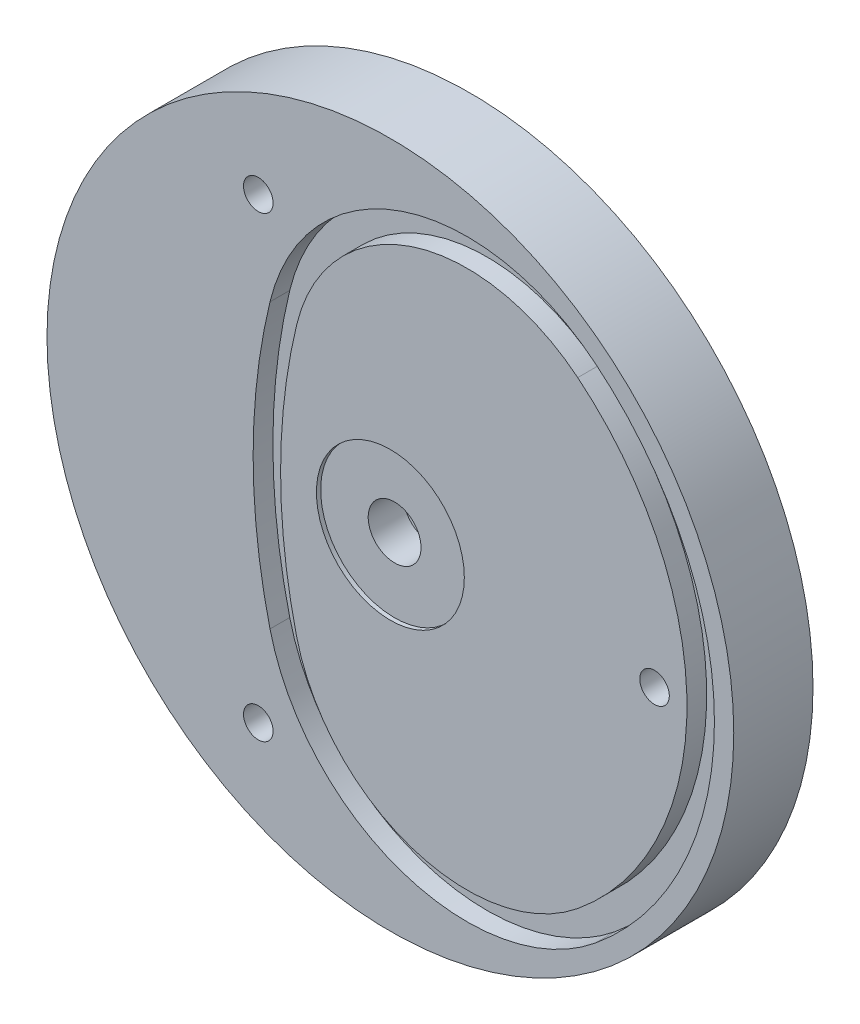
ISO-10303-21;
HEADER;
FILE_DESCRIPTION(('STEP AP214'),'2;1');
FILE_NAME('part.step','',(''),(''),'','','');
FILE_SCHEMA(('AUTOMOTIVE_DESIGN { 1 0 10303 214 1 1 1 1 }'));
ENDSEC;
DATA;
#1=APPLICATION_CONTEXT('core data for automotive mechanical design processes');
#2=APPLICATION_PROTOCOL_DEFINITION('international standard','automotive_design',2000,#1);
#3=PRODUCT_CONTEXT('',#1,'mechanical');
#4=PRODUCT('Part','Part','',(#3));
#5=PRODUCT_RELATED_PRODUCT_CATEGORY('part','',(#4));
#6=PRODUCT_DEFINITION_FORMATION('','',#4);
#7=PRODUCT_DEFINITION_CONTEXT('part definition',#1,'design');
#8=PRODUCT_DEFINITION('design','',#6,#7);
#9=PRODUCT_DEFINITION_SHAPE('','',#8);
#10=(LENGTH_UNIT() NAMED_UNIT(*) SI_UNIT(.MILLI.,.METRE.));
#11=(NAMED_UNIT(*) PLANE_ANGLE_UNIT() SI_UNIT($,.RADIAN.));
#12=(NAMED_UNIT(*) SI_UNIT($,.STERADIAN.) SOLID_ANGLE_UNIT());
#13=UNCERTAINTY_MEASURE_WITH_UNIT(LENGTH_MEASURE(1.E-05),#10,'distance_accuracy_value','');
#14=(GEOMETRIC_REPRESENTATION_CONTEXT(3) GLOBAL_UNCERTAINTY_ASSIGNED_CONTEXT((#13)) GLOBAL_UNIT_ASSIGNED_CONTEXT((#10,
#11,#12)) REPRESENTATION_CONTEXT('',''));
#15=CARTESIAN_POINT('',(0.,0.,0.));
#16=DIRECTION('',(0.,0.,1.));
#17=DIRECTION('',(1.,0.,0.));
#18=AXIS2_PLACEMENT_3D('',#15,#16,#17);
#19=CARTESIAN_POINT('',(0.,0.,19.05));
#20=DIRECTION('',(0.,0.,1.));
#21=DIRECTION('',(1.,0.,0.));
#22=AXIS2_PLACEMENT_3D('',#19,#20,#21);
#23=PLANE('',#22);
#24=CARTESIAN_POINT('',(-31.7499999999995,54.9926131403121,19.05));
#25=DIRECTION('',(0.,0.,1.));
#26=DIRECTION('',(-0.499999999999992,0.866025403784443,0.));
#27=AXIS2_PLACEMENT_3D('',#24,#25,#26);
#28=CIRCLE('',#27,3.556);
#29=CARTESIAN_POINT('',(-33.5279999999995,58.0721994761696,19.05));
#30=VERTEX_POINT('',#29);
#31=EDGE_CURVE('E174',#30,#30,#28,.T.);
#32=ORIENTED_EDGE('',*,*,#31,.F.);
#33=EDGE_LOOP('',(#32));
#34=FACE_BOUND('',#33,.T.);
#35=CARTESIAN_POINT('',(-31.7500000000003,-54.9926131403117,19.05));
#36=DIRECTION('',(0.,0.,1.));
#37=DIRECTION('',(-0.500000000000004,-0.866025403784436,0.));
#38=AXIS2_PLACEMENT_3D('',#35,#36,#37);
#39=CIRCLE('',#38,3.556);
#40=CARTESIAN_POINT('',(-33.5280000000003,-58.0721994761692,19.05));
#41=VERTEX_POINT('',#40);
#42=EDGE_CURVE('E180',#41,#41,#39,.T.);
#43=ORIENTED_EDGE('',*,*,#42,.F.);
#44=EDGE_LOOP('',(#43));
#45=FACE_BOUND('',#44,.T.);
#46=CARTESIAN_POINT('',(0.,0.,19.05));
#47=DIRECTION('',(0.,0.,1.));
#48=DIRECTION('',(1.,0.,0.));
#49=AXIS2_PLACEMENT_3D('',#46,#47,#48);
#50=CIRCLE('',#49,82.55);
#51=CARTESIAN_POINT('',(-82.55,0.,19.05));
#52=VERTEX_POINT('',#51);
#53=EDGE_CURVE('E11',#52,#52,#50,.T.);
#54=ORIENTED_EDGE('',*,*,#53,.T.);
#55=EDGE_LOOP('',(#54));
#56=FACE_BOUND('',#55,.T.);
#57=CARTESIAN_POINT('',(0.,0.,19.05));
#58=DIRECTION('',(0.,0.,-1.));
#59=DIRECTION('',(-1.,0.,0.));
#60=AXIS2_PLACEMENT_3D('',#57,#58,#59);
#61=CIRCLE('',#60,77.9018);
#62=CARTESIAN_POINT('',(49.2169599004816,60.3852738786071,19.05));
#63=VERTEX_POINT('',#62);
#64=CARTESIAN_POINT('',(49.2169599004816,-60.3852738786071,19.05));
#65=VERTEX_POINT('',#64);
#66=EDGE_CURVE('E146',#63,#65,#61,.T.);
#67=ORIENTED_EDGE('',*,*,#66,.T.);
#68=CARTESIAN_POINT('',(18.4291778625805,-22.611127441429,19.05));
#69=DIRECTION('',(0.,0.,-1.));
#70=DIRECTION('',(1.,0.,0.));
#71=AXIS2_PLACEMENT_3D('',#68,#69,#70);
#72=CIRCLE('',#71,48.7316494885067);
#73=CARTESIAN_POINT('',(-28.9401646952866,-34.0531136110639,19.05));
#74=VERTEX_POINT('',#73);
#75=EDGE_CURVE('E135',#65,#74,#72,.T.);
#76=ORIENTED_EDGE('',*,*,#75,.T.);
#77=CARTESIAN_POINT('',(112.038296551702,0.,19.05));
#78=DIRECTION('',(0.,0.,1.));
#79=DIRECTION('',(1.,0.,0.));
#80=AXIS2_PLACEMENT_3D('',#77,#78,#79);
#81=CIRCLE('',#80,145.032896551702);
#82=CARTESIAN_POINT('',(-28.9401646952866,34.0531136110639,19.05));
#83=VERTEX_POINT('',#82);
#84=EDGE_CURVE('E162',#83,#74,#81,.T.);
#85=ORIENTED_EDGE('',*,*,#84,.F.);
#86=CARTESIAN_POINT('',(18.4291778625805,22.611127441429,19.05));
#87=DIRECTION('',(0.,0.,1.));
#88=DIRECTION('',(1.,0.,0.));
#89=AXIS2_PLACEMENT_3D('',#86,#87,#88);
#90=CIRCLE('',#89,48.7316494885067);
#91=EDGE_CURVE('E151',#63,#83,#90,.T.);
#92=ORIENTED_EDGE('',*,*,#91,.F.);
#93=EDGE_LOOP('',(#67,#76,#85,#92));
#94=FACE_BOUND('',#93,.T.);
#95=ADVANCED_FACE('F35',(#34,#45,#56,#94),#23,.T.);
#96=CARTESIAN_POINT('',(0.,0.,19.05));
#97=DIRECTION('',(0.,0.,-1.));
#98=DIRECTION('',(-1.,0.,0.));
#99=AXIS2_PLACEMENT_3D('',#96,#97,#98);
#100=CYLINDRICAL_SURFACE('',#99,82.55);
#101=CARTESIAN_POINT('',(0.,0.,0.));
#102=DIRECTION('',(0.,0.,1.));
#103=DIRECTION('',(1.,0.,0.));
#104=AXIS2_PLACEMENT_3D('',#101,#102,#103);
#105=CIRCLE('',#104,82.55);
#106=CARTESIAN_POINT('',(-82.55,0.,0.));
#107=VERTEX_POINT('',#106);
#108=EDGE_CURVE('E44',#107,#107,#105,.T.);
#109=CARTESIAN_POINT('',(-82.55,0.,19.05));
#110=CARTESIAN_POINT('',(-82.55,0.,18.8515625));
#111=CARTESIAN_POINT('',(-82.55,0.,18.653125));
#112=CARTESIAN_POINT('',(-82.55,0.,18.25625));
#113=CARTESIAN_POINT('',(-82.55,0.,18.0578125));
#114=CARTESIAN_POINT('',(-82.55,0.,17.6609375));
#115=CARTESIAN_POINT('',(-82.55,0.,17.4625));
#116=CARTESIAN_POINT('',(-82.55,0.,17.065625));
#117=CARTESIAN_POINT('',(-82.55,0.,16.8671875));
#118=CARTESIAN_POINT('',(-82.55,0.,16.4703125));
#119=CARTESIAN_POINT('',(-82.55,0.,16.271875));
#120=CARTESIAN_POINT('',(-82.55,0.,15.875));
#121=CARTESIAN_POINT('',(-82.55,0.,15.6765625));
#122=CARTESIAN_POINT('',(-82.55,0.,15.2796875));
#123=CARTESIAN_POINT('',(-82.55,0.,15.08125));
#124=CARTESIAN_POINT('',(-82.55,0.,14.684375));
#125=CARTESIAN_POINT('',(-82.55,0.,14.4859375));
#126=CARTESIAN_POINT('',(-82.55,0.,14.0890625));
#127=CARTESIAN_POINT('',(-82.55,0.,13.890625));
#128=CARTESIAN_POINT('',(-82.55,0.,13.49375));
#129=CARTESIAN_POINT('',(-82.55,0.,13.2953125));
#130=CARTESIAN_POINT('',(-82.55,0.,12.8984375));
#131=CARTESIAN_POINT('',(-82.55,0.,12.7));
#132=CARTESIAN_POINT('',(-82.55,0.,12.303125));
#133=CARTESIAN_POINT('',(-82.55,0.,12.1046875));
#134=CARTESIAN_POINT('',(-82.55,0.,11.7078125));
#135=CARTESIAN_POINT('',(-82.55,0.,11.509375));
#136=CARTESIAN_POINT('',(-82.55,0.,11.1125));
#137=CARTESIAN_POINT('',(-82.55,0.,10.9140625));
#138=CARTESIAN_POINT('',(-82.55,0.,10.5171875));
#139=CARTESIAN_POINT('',(-82.55,0.,10.31875));
#140=CARTESIAN_POINT('',(-82.55,0.,9.921875));
#141=CARTESIAN_POINT('',(-82.55,0.,9.7234375));
#142=CARTESIAN_POINT('',(-82.55,0.,9.3265625));
#143=CARTESIAN_POINT('',(-82.55,0.,9.128125));
#144=CARTESIAN_POINT('',(-82.55,0.,8.73125));
#145=CARTESIAN_POINT('',(-82.55,0.,8.5328125));
#146=CARTESIAN_POINT('',(-82.55,0.,8.1359375));
#147=CARTESIAN_POINT('',(-82.55,0.,7.9375));
#148=CARTESIAN_POINT('',(-82.55,0.,7.540625));
#149=CARTESIAN_POINT('',(-82.55,0.,7.3421875));
#150=CARTESIAN_POINT('',(-82.55,0.,6.9453125));
#151=CARTESIAN_POINT('',(-82.55,0.,6.746875));
#152=CARTESIAN_POINT('',(-82.55,0.,6.35));
#153=CARTESIAN_POINT('',(-82.55,0.,6.1515625));
#154=CARTESIAN_POINT('',(-82.55,0.,5.7546875));
#155=CARTESIAN_POINT('',(-82.55,0.,5.55625));
#156=CARTESIAN_POINT('',(-82.55,0.,5.159375));
#157=CARTESIAN_POINT('',(-82.55,0.,4.9609375));
#158=CARTESIAN_POINT('',(-82.55,0.,4.5640625));
#159=CARTESIAN_POINT('',(-82.55,0.,4.365625));
#160=CARTESIAN_POINT('',(-82.55,0.,3.96875));
#161=CARTESIAN_POINT('',(-82.55,0.,3.7703125));
#162=CARTESIAN_POINT('',(-82.55,0.,3.3734375));
#163=CARTESIAN_POINT('',(-82.55,0.,3.175));
#164=CARTESIAN_POINT('',(-82.55,0.,2.778125));
#165=CARTESIAN_POINT('',(-82.55,0.,2.5796875));
#166=CARTESIAN_POINT('',(-82.55,0.,2.1828125));
#167=CARTESIAN_POINT('',(-82.55,0.,1.984375));
#168=CARTESIAN_POINT('',(-82.55,0.,1.5875));
#169=CARTESIAN_POINT('',(-82.55,0.,1.3890625));
#170=CARTESIAN_POINT('',(-82.55,0.,0.992187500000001));
#171=CARTESIAN_POINT('',(-82.55,0.,0.793750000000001));
#172=CARTESIAN_POINT('',(-82.55,0.,0.396875));
#173=CARTESIAN_POINT('',(-82.55,0.,0.1984375));
#174=CARTESIAN_POINT('',(-82.55,0.,0.));
#175=B_SPLINE_CURVE_WITH_KNOTS('',3,(#109,#110,#111,#112,#113,#114,#115,#116,#117,#118,#119,
#120,#121,#122,#123,#124,#125,#126,#127,#128,#129,#130,#131,#132,#133,#134,#135,#136,#137,#138,
#139,#140,#141,#142,#143,#144,#145,#146,#147,#148,#149,#150,#151,#152,#153,#154,#155,#156,#157,
#158,#159,#160,#161,#162,#163,#164,#165,#166,#167,#168,#169,#170,#171,#172,#173,#174),
.UNSPECIFIED.,.F.,.F.,(4,2,2,2,2,2,2,2,2,2,2,2,2,2,2,2,2,2,2,2,2,2,2,2,2,2,2,2,2,2,2,2,4),(0.,
0.595312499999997,1.190625,1.7859375,2.38125,2.9765625,3.571875,4.1671875,4.7625,5.3578125,
5.953125,6.5484375,7.14375,7.7390625,8.334375,8.9296875,9.525,10.1203125,10.715625,11.3109375,
11.90625,12.5015625,13.096875,13.6921875,14.2875,14.8828125,15.478125,16.0734375,16.66875,
17.2640625,17.859375,18.4546875,19.05),.UNSPECIFIED.);
#176=EDGE_CURVE('BSEAM37',#52,#107,#175,.T.);
#177=ORIENTED_EDGE('',*,*,#53,.F.);
#178=ORIENTED_EDGE('',*,*,#108,.T.);
#179=ORIENTED_EDGE('',*,*,#176,.T.);
#180=ORIENTED_EDGE('',*,*,#176,.F.);
#181=EDGE_LOOP('',(#177,#179,#178,#180));
#182=FACE_BOUND('',#181,.T.);
#183=ADVANCED_FACE('F37',(#182),#100,.T.);
#184=CARTESIAN_POINT('',(112.038296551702,0.,19.05));
#185=DIRECTION('',(0.,0.,1.));
#186=DIRECTION('',(1.,0.,0.));
#187=AXIS2_PLACEMENT_3D('',#184,#185,#186);
#188=CIRCLE('',#187,138.428896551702);
#189=CARTESIAN_POINT('',(-22.5207813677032,32.5025222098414,19.05));
#190=VERTEX_POINT('',#189);
#191=CARTESIAN_POINT('',(-22.5207813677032,-32.5025222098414,19.05));
#192=VERTEX_POINT('',#191);
#193=EDGE_CURVE('E167',#190,#192,#188,.T.);
#194=ORIENTED_EDGE('',*,*,#193,.T.);
#195=CARTESIAN_POINT('',(18.4291778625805,-22.611127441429,19.05));
#196=DIRECTION('',(0.,0.,-1.));
#197=DIRECTION('',(1.,0.,0.));
#198=AXIS2_PLACEMENT_3D('',#195,#196,#197);
#199=CIRCLE('',#198,42.1276494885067);
#200=CARTESIAN_POINT('',(45.0446711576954,-55.2662092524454,19.05));
#201=VERTEX_POINT('',#200);
#202=EDGE_CURVE('E139',#201,#192,#199,.T.);
#203=ORIENTED_EDGE('',*,*,#202,.F.);
#204=CARTESIAN_POINT('',(0.,0.,19.05));
#205=DIRECTION('',(0.,0.,-1.));
#206=DIRECTION('',(-1.,0.,0.));
#207=AXIS2_PLACEMENT_3D('',#204,#205,#206);
#208=CIRCLE('',#207,71.2978);
#209=CARTESIAN_POINT('',(45.0446711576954,55.2662092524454,19.05));
#210=VERTEX_POINT('',#209);
#211=EDGE_CURVE('E112',#210,#201,#208,.T.);
#212=ORIENTED_EDGE('',*,*,#211,.F.);
#213=CARTESIAN_POINT('',(18.4291778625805,22.611127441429,19.05));
#214=DIRECTION('',(0.,0.,1.));
#215=DIRECTION('',(1.,0.,0.));
#216=AXIS2_PLACEMENT_3D('',#213,#214,#215);
#217=CIRCLE('',#216,42.1276494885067);
#218=EDGE_CURVE('E154',#210,#190,#217,.T.);
#219=ORIENTED_EDGE('',*,*,#218,.T.);
#220=EDGE_LOOP('',(#194,#203,#212,#219));
#221=FACE_BOUND('',#220,.T.);
#222=CARTESIAN_POINT('',(63.5,0.,19.05));
#223=DIRECTION('',(0.,0.,1.));
#224=DIRECTION('',(1.,0.,0.));
#225=AXIS2_PLACEMENT_3D('',#222,#223,#224);
#226=CIRCLE('',#225,3.556);
#227=CARTESIAN_POINT('',(67.056,0.,19.05));
#228=VERTEX_POINT('',#227);
#229=EDGE_CURVE('E183',#228,#228,#226,.T.);
#230=ORIENTED_EDGE('',*,*,#229,.F.);
#231=EDGE_LOOP('',(#230));
#232=FACE_BOUND('',#231,.T.);
#233=CARTESIAN_POINT('',(0.,0.,19.05));
#234=DIRECTION('',(0.,0.,1.));
#235=DIRECTION('',(1.,0.,0.));
#236=AXIS2_PLACEMENT_3D('',#233,#234,#235);
#237=CIRCLE('',#236,17.78);
#238=CARTESIAN_POINT('',(17.78,0.,19.05));
#239=VERTEX_POINT('',#238);
#240=EDGE_CURVE('E198',#239,#239,#237,.T.);
#241=ORIENTED_EDGE('',*,*,#240,.F.);
#242=EDGE_LOOP('',(#241));
#243=FACE_BOUND('',#242,.T.);
#244=ADVANCED_FACE('F211',(#221,#232,#243),#23,.T.);
#245=CARTESIAN_POINT('',(0.,0.,0.));
#246=DIRECTION('',(0.,0.,1.));
#247=DIRECTION('',(1.,0.,0.));
#248=AXIS2_PLACEMENT_3D('',#245,#246,#247);
#249=PLANE('',#248);
#250=CARTESIAN_POINT('',(-31.7499999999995,54.9926131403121,0.));
#251=DIRECTION('',(0.,0.,1.));
#252=DIRECTION('',(-0.499999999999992,0.866025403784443,0.));
#253=AXIS2_PLACEMENT_3D('',#250,#251,#252);
#254=CIRCLE('',#253,3.556);
#255=CARTESIAN_POINT('',(-33.5279999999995,58.0721994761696,0.));
#256=VERTEX_POINT('',#255);
#257=EDGE_CURVE('E171',#256,#256,#254,.T.);
#258=ORIENTED_EDGE('',*,*,#257,.T.);
#259=EDGE_LOOP('',(#258));
#260=FACE_BOUND('',#259,.T.);
#261=CARTESIAN_POINT('',(-31.7500000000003,-54.9926131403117,0.));
#262=DIRECTION('',(0.,0.,1.));
#263=DIRECTION('',(-0.500000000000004,-0.866025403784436,0.));
#264=AXIS2_PLACEMENT_3D('',#261,#262,#263);
#265=CIRCLE('',#264,3.556);
#266=CARTESIAN_POINT('',(-33.5280000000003,-58.0721994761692,0.));
#267=VERTEX_POINT('',#266);
#268=EDGE_CURVE('E177',#267,#267,#265,.T.);
#269=ORIENTED_EDGE('',*,*,#268,.T.);
#270=EDGE_LOOP('',(#269));
#271=FACE_BOUND('',#270,.T.);
#272=CARTESIAN_POINT('',(63.5,0.,0.));
#273=DIRECTION('',(0.,0.,1.));
#274=DIRECTION('',(1.,0.,0.));
#275=AXIS2_PLACEMENT_3D('',#272,#273,#274);
#276=CIRCLE('',#275,3.556);
#277=CARTESIAN_POINT('',(67.056,0.,0.));
#278=VERTEX_POINT('',#277);
#279=EDGE_CURVE('E186',#278,#278,#276,.T.);
#280=ORIENTED_EDGE('',*,*,#279,.T.);
#281=EDGE_LOOP('',(#280));
#282=FACE_BOUND('',#281,.T.);
#283=CARTESIAN_POINT('',(0.,0.,0.));
#284=DIRECTION('',(0.,0.,-1.));
#285=DIRECTION('',(-1.,0.,0.));
#286=AXIS2_PLACEMENT_3D('',#283,#284,#285);
#287=CIRCLE('',#286,10.16);
#288=CARTESIAN_POINT('',(-10.16,0.,0.));
#289=VERTEX_POINT('',#288);
#290=EDGE_CURVE('E192',#289,#289,#287,.T.);
#291=ORIENTED_EDGE('',*,*,#290,.F.);
#292=EDGE_LOOP('',(#291));
#293=FACE_BOUND('',#292,.T.);
#294=ORIENTED_EDGE('',*,*,#108,.F.);
#295=EDGE_LOOP('',(#294));
#296=FACE_BOUND('',#295,.T.);
#297=ADVANCED_FACE('F208',(#260,#271,#282,#293,#296),#249,.F.);
#298=CARTESIAN_POINT('',(0.,0.,18.034));
#299=DIRECTION('',(0.,0.,1.));
#300=DIRECTION('',(1.,0.,0.));
#301=AXIS2_PLACEMENT_3D('',#298,#299,#300);
#302=CYLINDRICAL_SURFACE('',#301,17.78);
#303=CARTESIAN_POINT('',(0.,0.,18.034));
#304=DIRECTION('',(0.,0.,1.));
#305=DIRECTION('',(1.,0.,0.));
#306=AXIS2_PLACEMENT_3D('',#303,#304,#305);
#307=CIRCLE('',#306,17.78);
#308=CARTESIAN_POINT('',(17.78,0.,18.034));
#309=VERTEX_POINT('',#308);
#310=EDGE_CURVE('E201',#309,#309,#307,.T.);
#311=ORIENTED_EDGE('',*,*,#310,.F.);
#312=EDGE_LOOP('',(#311));
#313=FACE_BOUND('',#312,.T.);
#314=ORIENTED_EDGE('',*,*,#240,.T.);
#315=EDGE_LOOP('',(#314));
#316=FACE_BOUND('',#315,.T.);
#317=ADVANCED_FACE('F210',(#313,#316),#302,.F.);
#318=CARTESIAN_POINT('',(0.,0.,18.034));
#319=DIRECTION('',(0.,0.,1.));
#320=DIRECTION('',(1.,0.,0.));
#321=AXIS2_PLACEMENT_3D('',#318,#319,#320);
#322=PLANE('',#321);
#323=CARTESIAN_POINT('',(0.,0.,18.034));
#324=DIRECTION('',(0.,0.,1.));
#325=DIRECTION('',(1.,0.,0.));
#326=AXIS2_PLACEMENT_3D('',#323,#324,#325);
#327=CIRCLE('',#326,6.35);
#328=CARTESIAN_POINT('',(6.35,0.,18.034));
#329=VERTEX_POINT('',#328);
#330=EDGE_CURVE('E189',#329,#329,#327,.T.);
#331=ORIENTED_EDGE('',*,*,#330,.F.);
#332=EDGE_LOOP('',(#331));
#333=FACE_BOUND('',#332,.T.);
#334=ORIENTED_EDGE('',*,*,#310,.T.);
#335=EDGE_LOOP('',(#334));
#336=FACE_BOUND('',#335,.T.);
#337=ADVANCED_FACE('F214',(#333,#336),#322,.T.);
#338=CARTESIAN_POINT('',(0.,0.,9.525));
#339=DIRECTION('',(0.,0.,-1.));
#340=DIRECTION('',(-1.,0.,0.));
#341=AXIS2_PLACEMENT_3D('',#338,#339,#340);
#342=CYLINDRICAL_SURFACE('',#341,10.16);
#343=CARTESIAN_POINT('',(0.,0.,9.525));
#344=DIRECTION('',(0.,0.,-1.));
#345=DIRECTION('',(-1.,0.,0.));
#346=AXIS2_PLACEMENT_3D('',#343,#344,#345);
#347=CIRCLE('',#346,10.16);
#348=CARTESIAN_POINT('',(-10.16,0.,9.525));
#349=VERTEX_POINT('',#348);
#350=EDGE_CURVE('E195',#349,#349,#347,.T.);
#351=CARTESIAN_POINT('',(-10.16,0.,9.525));
#352=CARTESIAN_POINT('',(-10.16,0.,9.42578125));
#353=CARTESIAN_POINT('',(-10.16,0.,9.3265625));
#354=CARTESIAN_POINT('',(-10.16,0.,9.128125));
#355=CARTESIAN_POINT('',(-10.16,0.,9.02890625));
#356=CARTESIAN_POINT('',(-10.16,0.,8.83046875));
#357=CARTESIAN_POINT('',(-10.16,0.,8.73125));
#358=CARTESIAN_POINT('',(-10.16,0.,8.5328125));
#359=CARTESIAN_POINT('',(-10.16,0.,8.43359375));
#360=CARTESIAN_POINT('',(-10.16,0.,8.23515625));
#361=CARTESIAN_POINT('',(-10.16,0.,8.1359375));
#362=CARTESIAN_POINT('',(-10.16,0.,7.9375));
#363=CARTESIAN_POINT('',(-10.16,0.,7.83828125));
#364=CARTESIAN_POINT('',(-10.16,0.,7.63984375));
#365=CARTESIAN_POINT('',(-10.16,0.,7.540625));
#366=CARTESIAN_POINT('',(-10.16,0.,7.3421875));
#367=CARTESIAN_POINT('',(-10.16,0.,7.24296875));
#368=CARTESIAN_POINT('',(-10.16,0.,7.04453125));
#369=CARTESIAN_POINT('',(-10.16,0.,6.9453125));
#370=CARTESIAN_POINT('',(-10.16,0.,6.746875));
#371=CARTESIAN_POINT('',(-10.16,0.,6.64765625));
#372=CARTESIAN_POINT('',(-10.16,0.,6.44921875));
#373=CARTESIAN_POINT('',(-10.16,0.,6.35));
#374=CARTESIAN_POINT('',(-10.16,0.,6.1515625));
#375=CARTESIAN_POINT('',(-10.16,0.,6.05234375));
#376=CARTESIAN_POINT('',(-10.16,0.,5.85390625));
#377=CARTESIAN_POINT('',(-10.16,0.,5.7546875));
#378=CARTESIAN_POINT('',(-10.16,0.,5.55625));
#379=CARTESIAN_POINT('',(-10.16,0.,5.45703125));
#380=CARTESIAN_POINT('',(-10.16,0.,5.25859375));
#381=CARTESIAN_POINT('',(-10.16,0.,5.159375));
#382=CARTESIAN_POINT('',(-10.16,0.,4.9609375));
#383=CARTESIAN_POINT('',(-10.16,0.,4.86171875));
#384=CARTESIAN_POINT('',(-10.16,0.,4.66328125));
#385=CARTESIAN_POINT('',(-10.16,0.,4.5640625));
#386=CARTESIAN_POINT('',(-10.16,0.,4.365625));
#387=CARTESIAN_POINT('',(-10.16,0.,4.26640625));
#388=CARTESIAN_POINT('',(-10.16,0.,4.06796875));
#389=CARTESIAN_POINT('',(-10.16,0.,3.96875));
#390=CARTESIAN_POINT('',(-10.16,0.,3.7703125));
#391=CARTESIAN_POINT('',(-10.16,0.,3.67109375));
#392=CARTESIAN_POINT('',(-10.16,0.,3.47265625));
#393=CARTESIAN_POINT('',(-10.16,0.,3.3734375));
#394=CARTESIAN_POINT('',(-10.16,0.,3.175));
#395=CARTESIAN_POINT('',(-10.16,0.,3.07578125));
#396=CARTESIAN_POINT('',(-10.16,0.,2.87734375));
#397=CARTESIAN_POINT('',(-10.16,0.,2.778125));
#398=CARTESIAN_POINT('',(-10.16,0.,2.5796875));
#399=CARTESIAN_POINT('',(-10.16,0.,2.48046875));
#400=CARTESIAN_POINT('',(-10.16,0.,2.28203125));
#401=CARTESIAN_POINT('',(-10.16,0.,2.1828125));
#402=CARTESIAN_POINT('',(-10.16,0.,1.984375));
#403=CARTESIAN_POINT('',(-10.16,0.,1.88515625));
#404=CARTESIAN_POINT('',(-10.16,0.,1.68671875));
#405=CARTESIAN_POINT('',(-10.16,0.,1.5875));
#406=CARTESIAN_POINT('',(-10.16,0.,1.3890625));
#407=CARTESIAN_POINT('',(-10.16,0.,1.28984375));
#408=CARTESIAN_POINT('',(-10.16,0.,1.09140625));
#409=CARTESIAN_POINT('',(-10.16,0.,0.992187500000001));
#410=CARTESIAN_POINT('',(-10.16,0.,0.793750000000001));
#411=CARTESIAN_POINT('',(-10.16,0.,0.69453125));
#412=CARTESIAN_POINT('',(-10.16,0.,0.49609375));
#413=CARTESIAN_POINT('',(-10.16,0.,0.396875));
#414=CARTESIAN_POINT('',(-10.16,0.,0.1984375));
#415=CARTESIAN_POINT('',(-10.16,0.,0.0992187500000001));
#416=CARTESIAN_POINT('',(-10.16,0.,0.));
#417=B_SPLINE_CURVE_WITH_KNOTS('',3,(#351,#352,#353,#354,#355,#356,#357,#358,#359,#360,#361,
#362,#363,#364,#365,#366,#367,#368,#369,#370,#371,#372,#373,#374,#375,#376,#377,#378,#379,#380,
#381,#382,#383,#384,#385,#386,#387,#388,#389,#390,#391,#392,#393,#394,#395,#396,#397,#398,#399,
#400,#401,#402,#403,#404,#405,#406,#407,#408,#409,#410,#411,#412,#413,#414,#415,#416),
.UNSPECIFIED.,.F.,.F.,(4,2,2,2,2,2,2,2,2,2,2,2,2,2,2,2,2,2,2,2,2,2,2,2,2,2,2,2,2,2,2,2,4),(0.,
0.297656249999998,0.595312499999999,0.892968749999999,1.190625,1.48828125,1.7859375,2.08359375,
2.38125,2.67890625,2.9765625,3.27421875,3.571875,3.86953125,4.1671875,4.46484375,4.7625,
5.06015625,5.3578125,5.65546875,5.953125,6.25078125,6.5484375,6.84609375,7.14375,7.44140625,
7.7390625,8.03671875,8.334375,8.63203125,8.9296875,9.22734375,9.525),.UNSPECIFIED.);
#418=EDGE_CURVE('BSEAM225',#349,#289,#417,.T.);
#419=ORIENTED_EDGE('',*,*,#350,.F.);
#420=ORIENTED_EDGE('',*,*,#290,.T.);
#421=ORIENTED_EDGE('',*,*,#418,.T.);
#422=ORIENTED_EDGE('',*,*,#418,.F.);
#423=EDGE_LOOP('',(#419,#421,#420,#422));
#424=FACE_BOUND('',#423,.T.);
#425=ADVANCED_FACE('F225',(#424),#342,.F.);
#426=CARTESIAN_POINT('',(0.,0.,9.525));
#427=DIRECTION('',(0.,0.,-1.));
#428=DIRECTION('',(-1.,0.,0.));
#429=AXIS2_PLACEMENT_3D('',#426,#427,#428);
#430=PLANE('',#429);
#431=CARTESIAN_POINT('',(0.,0.,9.525));
#432=DIRECTION('',(0.,0.,-1.));
#433=DIRECTION('',(-1.,0.,0.));
#434=AXIS2_PLACEMENT_3D('',#431,#432,#433);
#435=CIRCLE('',#434,6.35);
#436=CARTESIAN_POINT('',(-6.35,0.,9.525));
#437=VERTEX_POINT('',#436);
#438=EDGE_CURVE('E39',#437,#437,#435,.T.);
#439=ORIENTED_EDGE('',*,*,#438,.F.);
#440=EDGE_LOOP('',(#439));
#441=FACE_BOUND('',#440,.T.);
#442=ORIENTED_EDGE('',*,*,#350,.T.);
#443=EDGE_LOOP('',(#442));
#444=FACE_BOUND('',#443,.T.);
#445=ADVANCED_FACE('F221',(#441,#444),#430,.T.);
#446=CARTESIAN_POINT('',(0.,0.,0.));
#447=DIRECTION('',(0.,0.,1.));
#448=DIRECTION('',(1.,0.,0.));
#449=AXIS2_PLACEMENT_3D('',#446,#447,#448);
#450=CYLINDRICAL_SURFACE('',#449,6.35);
#451=ORIENTED_EDGE('',*,*,#438,.T.);
#452=EDGE_LOOP('',(#451));
#453=FACE_BOUND('',#452,.T.);
#454=ORIENTED_EDGE('',*,*,#330,.T.);
#455=EDGE_LOOP('',(#454));
#456=FACE_BOUND('',#455,.T.);
#457=ADVANCED_FACE('F287',(#453,#456),#450,.F.);
#458=CARTESIAN_POINT('',(63.5,0.,0.));
#459=DIRECTION('',(0.,0.,1.));
#460=DIRECTION('',(1.,0.,0.));
#461=AXIS2_PLACEMENT_3D('',#458,#459,#460);
#462=CYLINDRICAL_SURFACE('',#461,3.556);
#463=CARTESIAN_POINT('',(67.056,0.,0.));
#464=CARTESIAN_POINT('',(67.056,0.,0.1984375));
#465=CARTESIAN_POINT('',(67.056,0.,0.396875));
#466=CARTESIAN_POINT('',(67.056,0.,0.79375));
#467=CARTESIAN_POINT('',(67.056,0.,0.9921875));
#468=CARTESIAN_POINT('',(67.056,0.,1.3890625));
#469=CARTESIAN_POINT('',(67.056,0.,1.5875));
#470=CARTESIAN_POINT('',(67.056,0.,1.984375));
#471=CARTESIAN_POINT('',(67.056,0.,2.1828125));
#472=CARTESIAN_POINT('',(67.056,0.,2.5796875));
#473=CARTESIAN_POINT('',(67.056,0.,2.778125));
#474=CARTESIAN_POINT('',(67.056,0.,3.175));
#475=CARTESIAN_POINT('',(67.056,0.,3.3734375));
#476=CARTESIAN_POINT('',(67.056,0.,3.7703125));
#477=CARTESIAN_POINT('',(67.056,0.,3.96875));
#478=CARTESIAN_POINT('',(67.056,0.,4.365625));
#479=CARTESIAN_POINT('',(67.056,0.,4.5640625));
#480=CARTESIAN_POINT('',(67.056,0.,4.9609375));
#481=CARTESIAN_POINT('',(67.056,0.,5.159375));
#482=CARTESIAN_POINT('',(67.056,0.,5.55625));
#483=CARTESIAN_POINT('',(67.056,0.,5.7546875));
#484=CARTESIAN_POINT('',(67.056,0.,6.1515625));
#485=CARTESIAN_POINT('',(67.056,0.,6.35));
#486=CARTESIAN_POINT('',(67.056,0.,6.746875));
#487=CARTESIAN_POINT('',(67.056,0.,6.9453125));
#488=CARTESIAN_POINT('',(67.056,0.,7.3421875));
#489=CARTESIAN_POINT('',(67.056,0.,7.540625));
#490=CARTESIAN_POINT('',(67.056,0.,7.9375));
#491=CARTESIAN_POINT('',(67.056,0.,8.1359375));
#492=CARTESIAN_POINT('',(67.056,0.,8.5328125));
#493=CARTESIAN_POINT('',(67.056,0.,8.73125));
#494=CARTESIAN_POINT('',(67.056,0.,9.128125));
#495=CARTESIAN_POINT('',(67.056,0.,9.3265625));
#496=CARTESIAN_POINT('',(67.056,0.,9.7234375));
#497=CARTESIAN_POINT('',(67.056,0.,9.921875));
#498=CARTESIAN_POINT('',(67.056,0.,10.31875));
#499=CARTESIAN_POINT('',(67.056,0.,10.5171875));
#500=CARTESIAN_POINT('',(67.056,0.,10.9140625));
#501=CARTESIAN_POINT('',(67.056,0.,11.1125));
#502=CARTESIAN_POINT('',(67.056,0.,11.509375));
#503=CARTESIAN_POINT('',(67.056,0.,11.7078125));
#504=CARTESIAN_POINT('',(67.056,0.,12.1046875));
#505=CARTESIAN_POINT('',(67.056,0.,12.303125));
#506=CARTESIAN_POINT('',(67.056,0.,12.7));
#507=CARTESIAN_POINT('',(67.056,0.,12.8984375));
#508=CARTESIAN_POINT('',(67.056,0.,13.2953125));
#509=CARTESIAN_POINT('',(67.056,0.,13.49375));
#510=CARTESIAN_POINT('',(67.056,0.,13.890625));
#511=CARTESIAN_POINT('',(67.056,0.,14.0890625));
#512=CARTESIAN_POINT('',(67.056,0.,14.4859375));
#513=CARTESIAN_POINT('',(67.056,0.,14.684375));
#514=CARTESIAN_POINT('',(67.056,0.,15.08125));
#515=CARTESIAN_POINT('',(67.056,0.,15.2796875));
#516=CARTESIAN_POINT('',(67.056,0.,15.6765625));
#517=CARTESIAN_POINT('',(67.056,0.,15.875));
#518=CARTESIAN_POINT('',(67.056,0.,16.271875));
#519=CARTESIAN_POINT('',(67.056,0.,16.4703125));
#520=CARTESIAN_POINT('',(67.056,0.,16.8671875));
#521=CARTESIAN_POINT('',(67.056,0.,17.065625));
#522=CARTESIAN_POINT('',(67.056,0.,17.4625));
#523=CARTESIAN_POINT('',(67.056,0.,17.6609375));
#524=CARTESIAN_POINT('',(67.056,0.,18.0578125));
#525=CARTESIAN_POINT('',(67.056,0.,18.25625));
#526=CARTESIAN_POINT('',(67.056,0.,18.653125));
#527=CARTESIAN_POINT('',(67.056,0.,18.8515625));
#528=CARTESIAN_POINT('',(67.056,0.,19.05));
#529=B_SPLINE_CURVE_WITH_KNOTS('',3,(#463,#464,#465,#466,#467,#468,#469,#470,#471,#472,#473,
#474,#475,#476,#477,#478,#479,#480,#481,#482,#483,#484,#485,#486,#487,#488,#489,#490,#491,#492,
#493,#494,#495,#496,#497,#498,#499,#500,#501,#502,#503,#504,#505,#506,#507,#508,#509,#510,#511,
#512,#513,#514,#515,#516,#517,#518,#519,#520,#521,#522,#523,#524,#525,#526,#527,#528),
.UNSPECIFIED.,.F.,.F.,(4,2,2,2,2,2,2,2,2,2,2,2,2,2,2,2,2,2,2,2,2,2,2,2,2,2,2,2,2,2,2,2,4),(0.,
0.5953125,1.190625,1.7859375,2.38125,2.9765625,3.571875,4.1671875,4.7625,5.3578125,5.953125,
6.5484375,7.14375,7.7390625,8.334375,8.9296875,9.525,10.1203125,10.715625,11.3109375,11.90625,
12.5015625,13.096875,13.6921875,14.2875,14.8828125,15.478125,16.0734375,16.66875,17.2640625,
17.859375,18.4546875,19.05),.UNSPECIFIED.);
#530=EDGE_CURVE('BSEAM283',#278,#228,#529,.T.);
#531=ORIENTED_EDGE('',*,*,#279,.F.);
#532=ORIENTED_EDGE('',*,*,#229,.T.);
#533=ORIENTED_EDGE('',*,*,#530,.T.);
#534=ORIENTED_EDGE('',*,*,#530,.F.);
#535=EDGE_LOOP('',(#531,#533,#532,#534));
#536=FACE_BOUND('',#535,.T.);
#537=ADVANCED_FACE('F283',(#536),#462,.F.);
#538=CARTESIAN_POINT('',(-31.7500000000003,-54.9926131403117,0.));
#539=DIRECTION('',(0.,0.,1.));
#540=DIRECTION('',(-0.500000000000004,-0.866025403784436,0.));
#541=AXIS2_PLACEMENT_3D('',#538,#539,#540);
#542=CYLINDRICAL_SURFACE('',#541,3.556);
#543=CARTESIAN_POINT('',(-33.5280000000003,-58.0721994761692,0.));
#544=CARTESIAN_POINT('',(-33.5280000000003,-58.0721994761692,0.1984375));
#545=CARTESIAN_POINT('',(-33.5280000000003,-58.0721994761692,0.396875));
#546=CARTESIAN_POINT('',(-33.5280000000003,-58.0721994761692,0.79375));
#547=CARTESIAN_POINT('',(-33.5280000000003,-58.0721994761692,0.9921875));
#548=CARTESIAN_POINT('',(-33.5280000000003,-58.0721994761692,1.3890625));
#549=CARTESIAN_POINT('',(-33.5280000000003,-58.0721994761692,1.5875));
#550=CARTESIAN_POINT('',(-33.5280000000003,-58.0721994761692,1.984375));
#551=CARTESIAN_POINT('',(-33.5280000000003,-58.0721994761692,2.1828125));
#552=CARTESIAN_POINT('',(-33.5280000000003,-58.0721994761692,2.5796875));
#553=CARTESIAN_POINT('',(-33.5280000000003,-58.0721994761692,2.778125));
#554=CARTESIAN_POINT('',(-33.5280000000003,-58.0721994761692,3.175));
#555=CARTESIAN_POINT('',(-33.5280000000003,-58.0721994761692,3.3734375));
#556=CARTESIAN_POINT('',(-33.5280000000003,-58.0721994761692,3.7703125));
#557=CARTESIAN_POINT('',(-33.5280000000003,-58.0721994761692,3.96875));
#558=CARTESIAN_POINT('',(-33.5280000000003,-58.0721994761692,4.365625));
#559=CARTESIAN_POINT('',(-33.5280000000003,-58.0721994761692,4.5640625));
#560=CARTESIAN_POINT('',(-33.5280000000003,-58.0721994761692,4.9609375));
#561=CARTESIAN_POINT('',(-33.5280000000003,-58.0721994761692,5.159375));
#562=CARTESIAN_POINT('',(-33.5280000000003,-58.0721994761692,5.55625));
#563=CARTESIAN_POINT('',(-33.5280000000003,-58.0721994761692,5.7546875));
#564=CARTESIAN_POINT('',(-33.5280000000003,-58.0721994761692,6.1515625));
#565=CARTESIAN_POINT('',(-33.5280000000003,-58.0721994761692,6.35));
#566=CARTESIAN_POINT('',(-33.5280000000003,-58.0721994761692,6.746875));
#567=CARTESIAN_POINT('',(-33.5280000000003,-58.0721994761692,6.9453125));
#568=CARTESIAN_POINT('',(-33.5280000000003,-58.0721994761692,7.3421875));
#569=CARTESIAN_POINT('',(-33.5280000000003,-58.0721994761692,7.540625));
#570=CARTESIAN_POINT('',(-33.5280000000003,-58.0721994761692,7.9375));
#571=CARTESIAN_POINT('',(-33.5280000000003,-58.0721994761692,8.1359375));
#572=CARTESIAN_POINT('',(-33.5280000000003,-58.0721994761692,8.5328125));
#573=CARTESIAN_POINT('',(-33.5280000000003,-58.0721994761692,8.73125));
#574=CARTESIAN_POINT('',(-33.5280000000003,-58.0721994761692,9.128125));
#575=CARTESIAN_POINT('',(-33.5280000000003,-58.0721994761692,9.3265625));
#576=CARTESIAN_POINT('',(-33.5280000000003,-58.0721994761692,9.7234375));
#577=CARTESIAN_POINT('',(-33.5280000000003,-58.0721994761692,9.921875));
#578=CARTESIAN_POINT('',(-33.5280000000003,-58.0721994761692,10.31875));
#579=CARTESIAN_POINT('',(-33.5280000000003,-58.0721994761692,10.5171875));
#580=CARTESIAN_POINT('',(-33.5280000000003,-58.0721994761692,10.9140625));
#581=CARTESIAN_POINT('',(-33.5280000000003,-58.0721994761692,11.1125));
#582=CARTESIAN_POINT('',(-33.5280000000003,-58.0721994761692,11.509375));
#583=CARTESIAN_POINT('',(-33.5280000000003,-58.0721994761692,11.7078125));
#584=CARTESIAN_POINT('',(-33.5280000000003,-58.0721994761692,12.1046875));
#585=CARTESIAN_POINT('',(-33.5280000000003,-58.0721994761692,12.303125));
#586=CARTESIAN_POINT('',(-33.5280000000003,-58.0721994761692,12.7));
#587=CARTESIAN_POINT('',(-33.5280000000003,-58.0721994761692,12.8984375));
#588=CARTESIAN_POINT('',(-33.5280000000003,-58.0721994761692,13.2953125));
#589=CARTESIAN_POINT('',(-33.5280000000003,-58.0721994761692,13.49375));
#590=CARTESIAN_POINT('',(-33.5280000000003,-58.0721994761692,13.890625));
#591=CARTESIAN_POINT('',(-33.5280000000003,-58.0721994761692,14.0890625));
#592=CARTESIAN_POINT('',(-33.5280000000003,-58.0721994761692,14.4859375));
#593=CARTESIAN_POINT('',(-33.5280000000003,-58.0721994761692,14.684375));
#594=CARTESIAN_POINT('',(-33.5280000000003,-58.0721994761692,15.08125));
#595=CARTESIAN_POINT('',(-33.5280000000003,-58.0721994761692,15.2796875));
#596=CARTESIAN_POINT('',(-33.5280000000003,-58.0721994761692,15.6765625));
#597=CARTESIAN_POINT('',(-33.5280000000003,-58.0721994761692,15.875));
#598=CARTESIAN_POINT('',(-33.5280000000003,-58.0721994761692,16.271875));
#599=CARTESIAN_POINT('',(-33.5280000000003,-58.0721994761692,16.4703125));
#600=CARTESIAN_POINT('',(-33.5280000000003,-58.0721994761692,16.8671875));
#601=CARTESIAN_POINT('',(-33.5280000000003,-58.0721994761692,17.065625));
#602=CARTESIAN_POINT('',(-33.5280000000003,-58.0721994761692,17.4625));
#603=CARTESIAN_POINT('',(-33.5280000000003,-58.0721994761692,17.6609375));
#604=CARTESIAN_POINT('',(-33.5280000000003,-58.0721994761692,18.0578125));
#605=CARTESIAN_POINT('',(-33.5280000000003,-58.0721994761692,18.25625));
#606=CARTESIAN_POINT('',(-33.5280000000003,-58.0721994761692,18.653125));
#607=CARTESIAN_POINT('',(-33.5280000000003,-58.0721994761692,18.8515625));
#608=CARTESIAN_POINT('',(-33.5280000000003,-58.0721994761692,19.05));
#609=B_SPLINE_CURVE_WITH_KNOTS('',3,(#543,#544,#545,#546,#547,#548,#549,#550,#551,#552,#553,
#554,#555,#556,#557,#558,#559,#560,#561,#562,#563,#564,#565,#566,#567,#568,#569,#570,#571,#572,
#573,#574,#575,#576,#577,#578,#579,#580,#581,#582,#583,#584,#585,#586,#587,#588,#589,#590,#591,
#592,#593,#594,#595,#596,#597,#598,#599,#600,#601,#602,#603,#604,#605,#606,#607,#608),
.UNSPECIFIED.,.F.,.F.,(4,2,2,2,2,2,2,2,2,2,2,2,2,2,2,2,2,2,2,2,2,2,2,2,2,2,2,2,2,2,2,2,4),(0.,
0.5953125,1.190625,1.7859375,2.38125,2.9765625,3.571875,4.1671875,4.7625,5.3578125,5.953125,
6.5484375,7.14375,7.7390625,8.334375,8.9296875,9.525,10.1203125,10.715625,11.3109375,11.90625,
12.5015625,13.096875,13.6921875,14.2875,14.8828125,15.478125,16.0734375,16.66875,17.2640625,
17.859375,18.4546875,19.05),.UNSPECIFIED.);
#610=EDGE_CURVE('BSEAM279',#267,#41,#609,.T.);
#611=ORIENTED_EDGE('',*,*,#268,.F.);
#612=ORIENTED_EDGE('',*,*,#42,.T.);
#613=ORIENTED_EDGE('',*,*,#610,.T.);
#614=ORIENTED_EDGE('',*,*,#610,.F.);
#615=EDGE_LOOP('',(#611,#613,#612,#614));
#616=FACE_BOUND('',#615,.T.);
#617=ADVANCED_FACE('F279',(#616),#542,.F.);
#618=CARTESIAN_POINT('',(-31.7499999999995,54.9926131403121,0.));
#619=DIRECTION('',(0.,0.,1.));
#620=DIRECTION('',(-0.499999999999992,0.866025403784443,0.));
#621=AXIS2_PLACEMENT_3D('',#618,#619,#620);
#622=CYLINDRICAL_SURFACE('',#621,3.556);
#623=CARTESIAN_POINT('',(-33.5279999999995,58.0721994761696,0.));
#624=CARTESIAN_POINT('',(-33.5279999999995,58.0721994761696,0.1984375));
#625=CARTESIAN_POINT('',(-33.5279999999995,58.0721994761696,0.396875));
#626=CARTESIAN_POINT('',(-33.5279999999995,58.0721994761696,0.79375));
#627=CARTESIAN_POINT('',(-33.5279999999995,58.0721994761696,0.9921875));
#628=CARTESIAN_POINT('',(-33.5279999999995,58.0721994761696,1.3890625));
#629=CARTESIAN_POINT('',(-33.5279999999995,58.0721994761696,1.5875));
#630=CARTESIAN_POINT('',(-33.5279999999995,58.0721994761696,1.984375));
#631=CARTESIAN_POINT('',(-33.5279999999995,58.0721994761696,2.1828125));
#632=CARTESIAN_POINT('',(-33.5279999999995,58.0721994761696,2.5796875));
#633=CARTESIAN_POINT('',(-33.5279999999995,58.0721994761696,2.778125));
#634=CARTESIAN_POINT('',(-33.5279999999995,58.0721994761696,3.175));
#635=CARTESIAN_POINT('',(-33.5279999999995,58.0721994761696,3.3734375));
#636=CARTESIAN_POINT('',(-33.5279999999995,58.0721994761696,3.7703125));
#637=CARTESIAN_POINT('',(-33.5279999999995,58.0721994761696,3.96875));
#638=CARTESIAN_POINT('',(-33.5279999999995,58.0721994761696,4.365625));
#639=CARTESIAN_POINT('',(-33.5279999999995,58.0721994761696,4.5640625));
#640=CARTESIAN_POINT('',(-33.5279999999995,58.0721994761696,4.9609375));
#641=CARTESIAN_POINT('',(-33.5279999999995,58.0721994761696,5.159375));
#642=CARTESIAN_POINT('',(-33.5279999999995,58.0721994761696,5.55625));
#643=CARTESIAN_POINT('',(-33.5279999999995,58.0721994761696,5.7546875));
#644=CARTESIAN_POINT('',(-33.5279999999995,58.0721994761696,6.1515625));
#645=CARTESIAN_POINT('',(-33.5279999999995,58.0721994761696,6.35));
#646=CARTESIAN_POINT('',(-33.5279999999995,58.0721994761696,6.746875));
#647=CARTESIAN_POINT('',(-33.5279999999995,58.0721994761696,6.9453125));
#648=CARTESIAN_POINT('',(-33.5279999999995,58.0721994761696,7.3421875));
#649=CARTESIAN_POINT('',(-33.5279999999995,58.0721994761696,7.540625));
#650=CARTESIAN_POINT('',(-33.5279999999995,58.0721994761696,7.9375));
#651=CARTESIAN_POINT('',(-33.5279999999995,58.0721994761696,8.1359375));
#652=CARTESIAN_POINT('',(-33.5279999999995,58.0721994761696,8.5328125));
#653=CARTESIAN_POINT('',(-33.5279999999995,58.0721994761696,8.73125));
#654=CARTESIAN_POINT('',(-33.5279999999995,58.0721994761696,9.128125));
#655=CARTESIAN_POINT('',(-33.5279999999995,58.0721994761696,9.3265625));
#656=CARTESIAN_POINT('',(-33.5279999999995,58.0721994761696,9.7234375));
#657=CARTESIAN_POINT('',(-33.5279999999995,58.0721994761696,9.921875));
#658=CARTESIAN_POINT('',(-33.5279999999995,58.0721994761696,10.31875));
#659=CARTESIAN_POINT('',(-33.5279999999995,58.0721994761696,10.5171875));
#660=CARTESIAN_POINT('',(-33.5279999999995,58.0721994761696,10.9140625));
#661=CARTESIAN_POINT('',(-33.5279999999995,58.0721994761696,11.1125));
#662=CARTESIAN_POINT('',(-33.5279999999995,58.0721994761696,11.509375));
#663=CARTESIAN_POINT('',(-33.5279999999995,58.0721994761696,11.7078125));
#664=CARTESIAN_POINT('',(-33.5279999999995,58.0721994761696,12.1046875));
#665=CARTESIAN_POINT('',(-33.5279999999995,58.0721994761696,12.303125));
#666=CARTESIAN_POINT('',(-33.5279999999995,58.0721994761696,12.7));
#667=CARTESIAN_POINT('',(-33.5279999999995,58.0721994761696,12.8984375));
#668=CARTESIAN_POINT('',(-33.5279999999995,58.0721994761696,13.2953125));
#669=CARTESIAN_POINT('',(-33.5279999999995,58.0721994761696,13.49375));
#670=CARTESIAN_POINT('',(-33.5279999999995,58.0721994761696,13.890625));
#671=CARTESIAN_POINT('',(-33.5279999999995,58.0721994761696,14.0890625));
#672=CARTESIAN_POINT('',(-33.5279999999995,58.0721994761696,14.4859375));
#673=CARTESIAN_POINT('',(-33.5279999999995,58.0721994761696,14.684375));
#674=CARTESIAN_POINT('',(-33.5279999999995,58.0721994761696,15.08125));
#675=CARTESIAN_POINT('',(-33.5279999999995,58.0721994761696,15.2796875));
#676=CARTESIAN_POINT('',(-33.5279999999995,58.0721994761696,15.6765625));
#677=CARTESIAN_POINT('',(-33.5279999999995,58.0721994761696,15.875));
#678=CARTESIAN_POINT('',(-33.5279999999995,58.0721994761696,16.271875));
#679=CARTESIAN_POINT('',(-33.5279999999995,58.0721994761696,16.4703125));
#680=CARTESIAN_POINT('',(-33.5279999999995,58.0721994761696,16.8671875));
#681=CARTESIAN_POINT('',(-33.5279999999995,58.0721994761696,17.065625));
#682=CARTESIAN_POINT('',(-33.5279999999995,58.0721994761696,17.4625));
#683=CARTESIAN_POINT('',(-33.5279999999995,58.0721994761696,17.6609375));
#684=CARTESIAN_POINT('',(-33.5279999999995,58.0721994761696,18.0578125));
#685=CARTESIAN_POINT('',(-33.5279999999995,58.0721994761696,18.25625));
#686=CARTESIAN_POINT('',(-33.5279999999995,58.0721994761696,18.653125));
#687=CARTESIAN_POINT('',(-33.5279999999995,58.0721994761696,18.8515625));
#688=CARTESIAN_POINT('',(-33.5279999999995,58.0721994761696,19.05));
#689=B_SPLINE_CURVE_WITH_KNOTS('',3,(#623,#624,#625,#626,#627,#628,#629,#630,#631,#632,#633,
#634,#635,#636,#637,#638,#639,#640,#641,#642,#643,#644,#645,#646,#647,#648,#649,#650,#651,#652,
#653,#654,#655,#656,#657,#658,#659,#660,#661,#662,#663,#664,#665,#666,#667,#668,#669,#670,#671,
#672,#673,#674,#675,#676,#677,#678,#679,#680,#681,#682,#683,#684,#685,#686,#687,#688),
.UNSPECIFIED.,.F.,.F.,(4,2,2,2,2,2,2,2,2,2,2,2,2,2,2,2,2,2,2,2,2,2,2,2,2,2,2,2,2,2,2,2,4),(0.,
0.5953125,1.190625,1.7859375,2.38125,2.9765625,3.571875,4.1671875,4.7625,5.3578125,5.953125,
6.5484375,7.14375,7.7390625,8.334375,8.9296875,9.525,10.1203125,10.715625,11.3109375,11.90625,
12.5015625,13.096875,13.6921875,14.2875,14.8828125,15.478125,16.0734375,16.66875,17.2640625,
17.859375,18.4546875,19.05),.UNSPECIFIED.);
#690=EDGE_CURVE('BSEAM275',#256,#30,#689,.T.);
#691=ORIENTED_EDGE('',*,*,#257,.F.);
#692=ORIENTED_EDGE('',*,*,#31,.T.);
#693=ORIENTED_EDGE('',*,*,#690,.T.);
#694=ORIENTED_EDGE('',*,*,#690,.F.);
#695=EDGE_LOOP('',(#691,#693,#692,#694));
#696=FACE_BOUND('',#695,.T.);
#697=ADVANCED_FACE('F275',(#696),#622,.F.);
#698=CARTESIAN_POINT('',(112.038296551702,0.,19.05));
#699=DIRECTION('',(0.,0.,1.));
#700=DIRECTION('',(1.,0.,0.));
#701=AXIS2_PLACEMENT_3D('',#698,#699,#700);
#702=CYLINDRICAL_SURFACE('',#701,138.428896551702);
#703=DIRECTION('',(0.,0.,1.));
#704=VECTOR('',#703,1.);
#705=CARTESIAN_POINT('',(-22.5207813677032,32.5025222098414,14.3002));
#706=LINE('',#705,#704);
#707=CARTESIAN_POINT('',(-22.5207813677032,32.5025222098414,14.3002));
#708=VERTEX_POINT('',#707);
#709=EDGE_CURVE('E155',#708,#190,#706,.T.);
#710=ORIENTED_EDGE('',*,*,#709,.F.);
#711=CARTESIAN_POINT('',(112.038296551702,0.,14.3002));
#712=DIRECTION('',(0.,0.,1.));
#713=DIRECTION('',(1.,0.,0.));
#714=AXIS2_PLACEMENT_3D('',#711,#712,#713);
#715=CIRCLE('',#714,138.428896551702);
#716=CARTESIAN_POINT('',(-22.5207813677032,-32.5025222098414,14.3002));
#717=VERTEX_POINT('',#716);
#718=EDGE_CURVE('E59',#708,#717,#715,.T.);
#719=ORIENTED_EDGE('',*,*,#718,.T.);
#720=DIRECTION('',(0.,0.,1.));
#721=VECTOR('',#720,1.);
#722=CARTESIAN_POINT('',(-22.5207813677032,-32.5025222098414,14.3002));
#723=LINE('',#722,#721);
#724=EDGE_CURVE('E125',#717,#192,#723,.T.);
#725=ORIENTED_EDGE('',*,*,#724,.T.);
#726=ORIENTED_EDGE('',*,*,#193,.F.);
#727=EDGE_LOOP('',(#710,#719,#725,#726));
#728=FACE_BOUND('',#727,.T.);
#729=ADVANCED_FACE('F272',(#728),#702,.T.);
#730=CARTESIAN_POINT('',(112.038296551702,0.,19.05));
#731=DIRECTION('',(0.,0.,1.));
#732=DIRECTION('',(1.,0.,0.));
#733=AXIS2_PLACEMENT_3D('',#730,#731,#732);
#734=CYLINDRICAL_SURFACE('',#733,145.032896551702);
#735=DIRECTION('',(0.,0.,-1.));
#736=VECTOR('',#735,1.);
#737=CARTESIAN_POINT('',(-28.9401646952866,34.0531136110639,19.05));
#738=LINE('',#737,#736);
#739=CARTESIAN_POINT('',(-28.9401646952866,34.0531136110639,14.3002));
#740=VERTEX_POINT('',#739);
#741=EDGE_CURVE('E150',#83,#740,#738,.T.);
#742=ORIENTED_EDGE('',*,*,#741,.F.);
#743=ORIENTED_EDGE('',*,*,#84,.T.);
#744=DIRECTION('',(0.,0.,-1.));
#745=VECTOR('',#744,1.);
#746=CARTESIAN_POINT('',(-28.9401646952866,-34.0531136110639,19.05));
#747=LINE('',#746,#745);
#748=CARTESIAN_POINT('',(-28.9401646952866,-34.0531136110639,14.3002));
#749=VERTEX_POINT('',#748);
#750=EDGE_CURVE('E126',#74,#749,#747,.T.);
#751=ORIENTED_EDGE('',*,*,#750,.T.);
#752=CARTESIAN_POINT('',(112.038296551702,0.,14.3002));
#753=DIRECTION('',(0.,0.,1.));
#754=DIRECTION('',(1.,0.,0.));
#755=AXIS2_PLACEMENT_3D('',#752,#753,#754);
#756=CIRCLE('',#755,145.032896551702);
#757=EDGE_CURVE('E51',#740,#749,#756,.T.);
#758=ORIENTED_EDGE('',*,*,#757,.F.);
#759=EDGE_LOOP('',(#742,#743,#751,#758));
#760=FACE_BOUND('',#759,.T.);
#761=ADVANCED_FACE('F252',(#760),#734,.F.);
#762=CARTESIAN_POINT('',(18.4291778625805,22.611127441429,19.05));
#763=DIRECTION('',(0.,0.,1.));
#764=DIRECTION('',(1.,0.,0.));
#765=AXIS2_PLACEMENT_3D('',#762,#763,#764);
#766=CYLINDRICAL_SURFACE('',#765,42.1276494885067);
#767=DIRECTION('',(0.,0.,1.));
#768=VECTOR('',#767,1.);
#769=CARTESIAN_POINT('',(45.0446711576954,55.2662092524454,14.3002));
#770=LINE('',#769,#768);
#771=CARTESIAN_POINT('',(45.0446711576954,55.2662092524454,14.3002));
#772=VERTEX_POINT('',#771);
#773=EDGE_CURVE('E144',#772,#210,#770,.T.);
#774=ORIENTED_EDGE('',*,*,#773,.F.);
#775=CARTESIAN_POINT('',(18.4291778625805,22.611127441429,14.3002));
#776=DIRECTION('',(0.,0.,1.));
#777=DIRECTION('',(1.,0.,0.));
#778=AXIS2_PLACEMENT_3D('',#775,#776,#777);
#779=CIRCLE('',#778,42.1276494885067);
#780=EDGE_CURVE('E107',#772,#708,#779,.T.);
#781=ORIENTED_EDGE('',*,*,#780,.T.);
#782=ORIENTED_EDGE('',*,*,#709,.T.);
#783=ORIENTED_EDGE('',*,*,#218,.F.);
#784=EDGE_LOOP('',(#774,#781,#782,#783));
#785=FACE_BOUND('',#784,.T.);
#786=ADVANCED_FACE('F266',(#785),#766,.T.);
#787=CARTESIAN_POINT('',(18.4291778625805,22.611127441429,19.05));
#788=DIRECTION('',(0.,0.,1.));
#789=DIRECTION('',(1.,0.,0.));
#790=AXIS2_PLACEMENT_3D('',#787,#788,#789);
#791=CYLINDRICAL_SURFACE('',#790,48.7316494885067);
#792=DIRECTION('',(0.,0.,-1.));
#793=VECTOR('',#792,1.);
#794=CARTESIAN_POINT('',(49.2169599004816,60.3852738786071,19.05));
#795=LINE('',#794,#793);
#796=CARTESIAN_POINT('',(49.2169599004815,60.3852738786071,14.3002));
#797=VERTEX_POINT('',#796);
#798=EDGE_CURVE('E141',#63,#797,#795,.T.);
#799=ORIENTED_EDGE('',*,*,#798,.F.);
#800=ORIENTED_EDGE('',*,*,#91,.T.);
#801=ORIENTED_EDGE('',*,*,#741,.T.);
#802=CARTESIAN_POINT('',(18.4291778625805,22.611127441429,14.3002));
#803=DIRECTION('',(0.,0.,1.));
#804=DIRECTION('',(1.,0.,0.));
#805=AXIS2_PLACEMENT_3D('',#802,#803,#804);
#806=CIRCLE('',#805,48.7316494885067);
#807=EDGE_CURVE('E159',#797,#740,#806,.T.);
#808=ORIENTED_EDGE('',*,*,#807,.F.);
#809=EDGE_LOOP('',(#799,#800,#801,#808));
#810=FACE_BOUND('',#809,.T.);
#811=ADVANCED_FACE('F254',(#810),#791,.F.);
#812=CARTESIAN_POINT('',(0.,0.,19.05));
#813=DIRECTION('',(0.,0.,-1.));
#814=DIRECTION('',(-1.,0.,0.));
#815=AXIS2_PLACEMENT_3D('',#812,#813,#814);
#816=CYLINDRICAL_SURFACE('',#815,77.9018);
#817=CARTESIAN_POINT('',(0.,0.,14.3002));
#818=DIRECTION('',(0.,0.,-1.));
#819=DIRECTION('',(-1.,0.,0.));
#820=AXIS2_PLACEMENT_3D('',#817,#818,#819);
#821=CIRCLE('',#820,77.9018);
#822=CARTESIAN_POINT('',(49.2169599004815,-60.3852738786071,14.3002));
#823=VERTEX_POINT('',#822);
#824=EDGE_CURVE('E111',#797,#823,#821,.T.);
#825=ORIENTED_EDGE('',*,*,#824,.T.);
#826=DIRECTION('',(0.,0.,-1.));
#827=VECTOR('',#826,1.);
#828=CARTESIAN_POINT('',(49.2169599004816,-60.3852738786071,19.05));
#829=LINE('',#828,#827);
#830=EDGE_CURVE('E128',#65,#823,#829,.T.);
#831=ORIENTED_EDGE('',*,*,#830,.F.);
#832=ORIENTED_EDGE('',*,*,#66,.F.);
#833=ORIENTED_EDGE('',*,*,#798,.T.);
#834=EDGE_LOOP('',(#825,#831,#832,#833));
#835=FACE_BOUND('',#834,.T.);
#836=ADVANCED_FACE('F246',(#835),#816,.F.);
#837=CARTESIAN_POINT('',(49.2169599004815,60.3852738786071,14.3002));
#838=DIRECTION('',(0.,0.,1.));
#839=DIRECTION('',(1.,0.,0.));
#840=AXIS2_PLACEMENT_3D('',#837,#838,#839);
#841=PLANE('',#840);
#842=CARTESIAN_POINT('',(18.4291778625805,-22.611127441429,14.3002));
#843=DIRECTION('',(0.,0.,-1.));
#844=DIRECTION('',(1.,0.,0.));
#845=AXIS2_PLACEMENT_3D('',#842,#843,#844);
#846=CIRCLE('',#845,42.1276494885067);
#847=CARTESIAN_POINT('',(45.0446711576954,-55.2662092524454,14.3002));
#848=VERTEX_POINT('',#847);
#849=EDGE_CURVE('E104',#848,#717,#846,.T.);
#850=ORIENTED_EDGE('',*,*,#849,.T.);
#851=ORIENTED_EDGE('',*,*,#718,.F.);
#852=ORIENTED_EDGE('',*,*,#780,.F.);
#853=CARTESIAN_POINT('',(0.,0.,14.3002));
#854=DIRECTION('',(0.,0.,-1.));
#855=DIRECTION('',(-1.,0.,0.));
#856=AXIS2_PLACEMENT_3D('',#853,#854,#855);
#857=CIRCLE('',#856,71.2978);
#858=EDGE_CURVE('E99',#772,#848,#857,.T.);
#859=ORIENTED_EDGE('',*,*,#858,.T.);
#860=EDGE_LOOP('',(#850,#851,#852,#859));
#861=FACE_BOUND('',#860,.T.);
#862=ORIENTED_EDGE('',*,*,#757,.T.);
#863=CARTESIAN_POINT('',(18.4291778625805,-22.611127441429,14.3002));
#864=DIRECTION('',(0.,0.,-1.));
#865=DIRECTION('',(1.,0.,0.));
#866=AXIS2_PLACEMENT_3D('',#863,#864,#865);
#867=CIRCLE('',#866,48.7316494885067);
#868=EDGE_CURVE('E121',#823,#749,#867,.T.);
#869=ORIENTED_EDGE('',*,*,#868,.F.);
#870=ORIENTED_EDGE('',*,*,#824,.F.);
#871=ORIENTED_EDGE('',*,*,#807,.T.);
#872=EDGE_LOOP('',(#862,#869,#870,#871));
#873=FACE_BOUND('',#872,.T.);
#874=ADVANCED_FACE('F101',(#861,#873),#841,.T.);
#875=CARTESIAN_POINT('',(0.,0.,19.05));
#876=DIRECTION('',(0.,0.,-1.));
#877=DIRECTION('',(-1.,0.,0.));
#878=AXIS2_PLACEMENT_3D('',#875,#876,#877);
#879=CYLINDRICAL_SURFACE('',#878,71.2978);
#880=ORIENTED_EDGE('',*,*,#211,.T.);
#881=DIRECTION('',(0.,0.,1.));
#882=VECTOR('',#881,1.);
#883=CARTESIAN_POINT('',(45.0446711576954,-55.2662092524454,14.3002));
#884=LINE('',#883,#882);
#885=EDGE_CURVE('E115',#848,#201,#884,.T.);
#886=ORIENTED_EDGE('',*,*,#885,.F.);
#887=ORIENTED_EDGE('',*,*,#858,.F.);
#888=ORIENTED_EDGE('',*,*,#773,.T.);
#889=EDGE_LOOP('',(#880,#886,#887,#888));
#890=FACE_BOUND('',#889,.T.);
#891=ADVANCED_FACE('F116',(#890),#879,.T.);
#892=CARTESIAN_POINT('',(18.4291778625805,-22.611127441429,19.05));
#893=DIRECTION('',(0.,0.,1.));
#894=DIRECTION('',(1.,0.,0.));
#895=AXIS2_PLACEMENT_3D('',#892,#893,#894);
#896=CYLINDRICAL_SURFACE('',#895,42.1276494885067);
#897=ORIENTED_EDGE('',*,*,#885,.T.);
#898=ORIENTED_EDGE('',*,*,#202,.T.);
#899=ORIENTED_EDGE('',*,*,#724,.F.);
#900=ORIENTED_EDGE('',*,*,#849,.F.);
#901=EDGE_LOOP('',(#897,#898,#899,#900));
#902=FACE_BOUND('',#901,.T.);
#903=ADVANCED_FACE('F123',(#902),#896,.T.);
#904=CARTESIAN_POINT('',(18.4291778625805,-22.611127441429,19.05));
#905=DIRECTION('',(0.,0.,1.));
#906=DIRECTION('',(1.,0.,0.));
#907=AXIS2_PLACEMENT_3D('',#904,#905,#906);
#908=CYLINDRICAL_SURFACE('',#907,48.7316494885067);
#909=ORIENTED_EDGE('',*,*,#830,.T.);
#910=ORIENTED_EDGE('',*,*,#868,.T.);
#911=ORIENTED_EDGE('',*,*,#750,.F.);
#912=ORIENTED_EDGE('',*,*,#75,.F.);
#913=EDGE_LOOP('',(#909,#910,#911,#912));
#914=FACE_BOUND('',#913,.T.);
#915=ADVANCED_FACE('F251',(#914),#908,.F.);
#916=CLOSED_SHELL('',(#95,#183,#244,#297,#317,#337,#425,#445,#457,#537,#617,#697,#729,#761,#786,
#811,#836,#874,#891,#903,#915));
#917=MANIFOLD_SOLID_BREP('B2',#916);
#918=ADVANCED_BREP_SHAPE_REPRESENTATION('',(#18,#917),#14);
#919=SHAPE_DEFINITION_REPRESENTATION(#9,#918);
ENDSEC;
END-ISO-10303-21;
